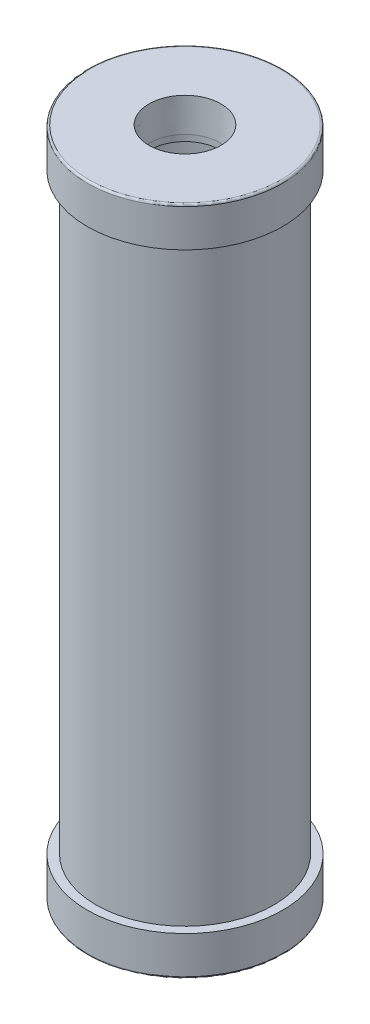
from build123d import *

# Parameters (mm, degrees)
SKETCH1_R           = 57.15
SKETCH1_R_2         = 50.546
BOSS_EXTRUDE1_DEPTH = 431.8
SKETCH2_R           = 62.865
BOSS_EXTRUDE2_DEPTH = 25.4
BOSS_EXTRUDE3_START = -25.4
SKETCH5_R           = 62.865
BOSS_EXTRUDE3_DEPTH = 25.4
FILLET1_R           = 1.27


with BuildPart() as part:
    # Sketch1 → Boss-Extrude1 (new body)
    with BuildSketch(Plane(origin=(0, 0, 0), x_dir=(1, 0, 0), z_dir=(0, 1, 0))):
        with Locations(Location((0, 0, 0), (0, 0, 270))):
            Circle(SKETCH1_R)
        with Locations(Location((0, 0, 0), (0, 0, 270))):
            Circle(SKETCH1_R_2, mode=Mode.SUBTRACT)
    extrude(amount=BOSS_EXTRUDE1_DEPTH)

    # Sketch2 → Boss-Extrude2 (add)
    with BuildSketch(Plane(origin=(0, 0, 0), x_dir=(1, 0, 0), z_dir=(0, 1, 0))):
        with Locations(Location((0, 0, 0), (0, 0, 270))):
            Circle(SKETCH2_R)
    extrude(amount=BOSS_EXTRUDE2_DEPTH)

    # Sketch3 → 1-1_2 Rc Tapped Hole1 (revolve, cut)
    with BuildSketch(Plane(origin=(0, 0, 0), x_dir=(0, 0, -1), z_dir=(1, 0, 0))):
        Polygon((0, 0), (0, 46.34544999), (22.6, 32.766), (22.6, 21.336), (22.493964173, 21.336), (23.160002, 0), align=None)
    revolve(axis=Axis((0, -6.35, 0), (0, 1, 0)), mode=Mode.SUBTRACT)

    # Sketch5 → Boss-Extrude3 (add)
    with BuildSketch(Plane(origin=(0, 431.8, 0), x_dir=(1, 0, 0), z_dir=(0, 1, 0)).offset(BOSS_EXTRUDE3_START)):
        with Locations(Location((0, 0, 0), (0, 0, 270))):
            Circle(SKETCH5_R)
    extrude(amount=BOSS_EXTRUDE3_DEPTH)

    # Sketch6 → 1-1_2 Rc Tapped Hole2 (revolve, cut)
    with BuildSketch(Plane(origin=(0, 431.8, 0), x_dir=(0, 0, 1), z_dir=(1, 0, 0))):
        Polygon((0, 0), (0, 46.34544999), (22.6, 32.766), (22.6, 21.336), (22.493964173, 21.336), (23.160002, 0), align=None)
    revolve(axis=Axis((0, 438.15, 0), (0, -1, 0)), mode=Mode.SUBTRACT)

    # Fillet1
    fillet1_edges = [part.edges().sort_by_distance(p)[0] for p in [
        (0, 0, -62.865),
        (0, 431.8, -62.865),
    ]]
    fillet(fillet1_edges, radius=FILLET1_R)


solid = part.part
